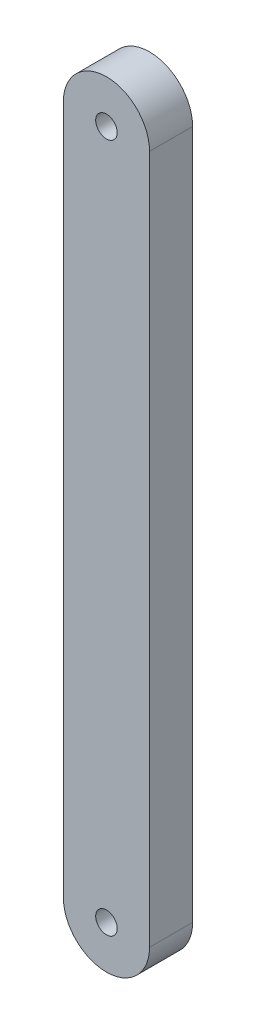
from build123d import *

# Parameters (mm, degrees)
Y_KSEKLIK_EKSTR_ZYON1_DEPTH = 20
IZIM2_R                     = 50
Y_KSEKLIK_EKSTR_ZYON2_DEPTH = 100
IZIM3_R                     = 5
KES_EKSTR_ZYON1_DEPTH       = 100
KES_EKSTR_ZYON2_START       = -100
IZIM4_R                     = 50
KES_EKSTR_ZYON2_DEPTH       = 100
IZIM5_W                     = 40
IZIM5_H                     = 20
Y_KSEKLIK_EKSTR_ZYON3_DEPTH = 60
IZIM6_R                     = 50
Y_KSEKLIK_EKSTR_ZYON4_DEPTH = 100
KES_EKSTR_ZYON3_START       = -100
IZIM7_R                     = 50
KES_EKSTR_ZYON3_DEPTH       = 100
Y_KSEKLIK_EKSTR_ZYON5_DEPTH = 20
IZIM9_R                     = 5
KES_EKSTR_ZYON4_DEPTH       = 20


with BuildPart() as part:
    # izim1 → Y_kseklik-Ekstr_zyon1 (new body)
    with BuildSketch(Plane.XY):
        with BuildLine():
            Line((-20, 125), (20, 125))
            Line((20, 125), (20, -125))
            ThreePointArc((20, -125), (0, -145), (-20, -125))
            Line((-20, -125), (-20, 125))
        make_face()
    extrude(amount=Y_KSEKLIK_EKSTR_ZYON1_DEPTH)

    # izim2 → Y_kseklik-Ekstr_zyon2 (add)
    with BuildSketch(Plane(origin=(0, 125, 0), x_dir=(1, 0, 0), z_dir=(0, 1, 0))):
        with Locations(Location((0, -10, 0), (0, 0, 90))):
            Circle(IZIM2_R)
    extrude(amount=Y_KSEKLIK_EKSTR_ZYON2_DEPTH)

    # izim3 → Kes-Ekstr_zyon1 (cut)
    with BuildSketch(Plane.XY.offset(20)):
        with Locations((0, -125)):
            Circle(IZIM3_R)
    extrude(amount=-KES_EKSTR_ZYON1_DEPTH, mode=Mode.SUBTRACT)

    # izim4 → Kes-Ekstr_zyon2 (cut)
    with BuildSketch(Plane(origin=(0, 225, 0), x_dir=(1, 0, 0), z_dir=(0, 1, 0)).offset(KES_EKSTR_ZYON2_START)):
        with Locations((0, -10)):
            Circle(IZIM4_R)
    extrude(amount=KES_EKSTR_ZYON2_DEPTH, mode=Mode.SUBTRACT)

    # izim5 → Y_kseklik-Ekstr_zyon3 (add)
    with BuildSketch(Plane(origin=(0, 125, 0), x_dir=(1, 0, 0), z_dir=(0, 1, 0))):
        with Locations((0, -10)):
            Rectangle(IZIM5_W, IZIM5_H)
    extrude(amount=Y_KSEKLIK_EKSTR_ZYON3_DEPTH)

    # izim6 → Y_kseklik-Ekstr_zyon4 (add)
    with BuildSketch(Plane(origin=(0, 185, 0), x_dir=(1, 0, 0), z_dir=(0, 1, 0))):
        with Locations(Location((0, -10, 0), (0, 0, 90))):
            Circle(IZIM6_R)
    extrude(amount=Y_KSEKLIK_EKSTR_ZYON4_DEPTH)

    # izim7 → Kes-Ekstr_zyon3 (cut)
    with BuildSketch(Plane(origin=(0, 285, 0), x_dir=(1, 0, 0), z_dir=(0, 1, 0)).offset(KES_EKSTR_ZYON3_START)):
        with Locations((0, -10)):
            Circle(IZIM7_R)
    extrude(amount=KES_EKSTR_ZYON3_DEPTH, mode=Mode.SUBTRACT)

    # izim8 → Y_kseklik-Ekstr_zyon5 (add)
    with BuildSketch(Plane.XY.offset(20)):
        with BuildLine():
            Line((20, 185), (20, 195))
            ThreePointArc((20, 195), (0, 215), (-20, 195))
            Line((-20, 195), (-20, 185))
            Line((-20, 185), (20, 185))
        make_face()
    extrude(amount=-Y_KSEKLIK_EKSTR_ZYON5_DEPTH)

    # izim9 → Kes-Ekstr_zyon4 (cut)
    with BuildSketch(Plane.XY.offset(20)):
        with Locations((0, 195)):
            Circle(IZIM9_R)
    extrude(amount=-KES_EKSTR_ZYON4_DEPTH, mode=Mode.SUBTRACT)


solid = part.part
